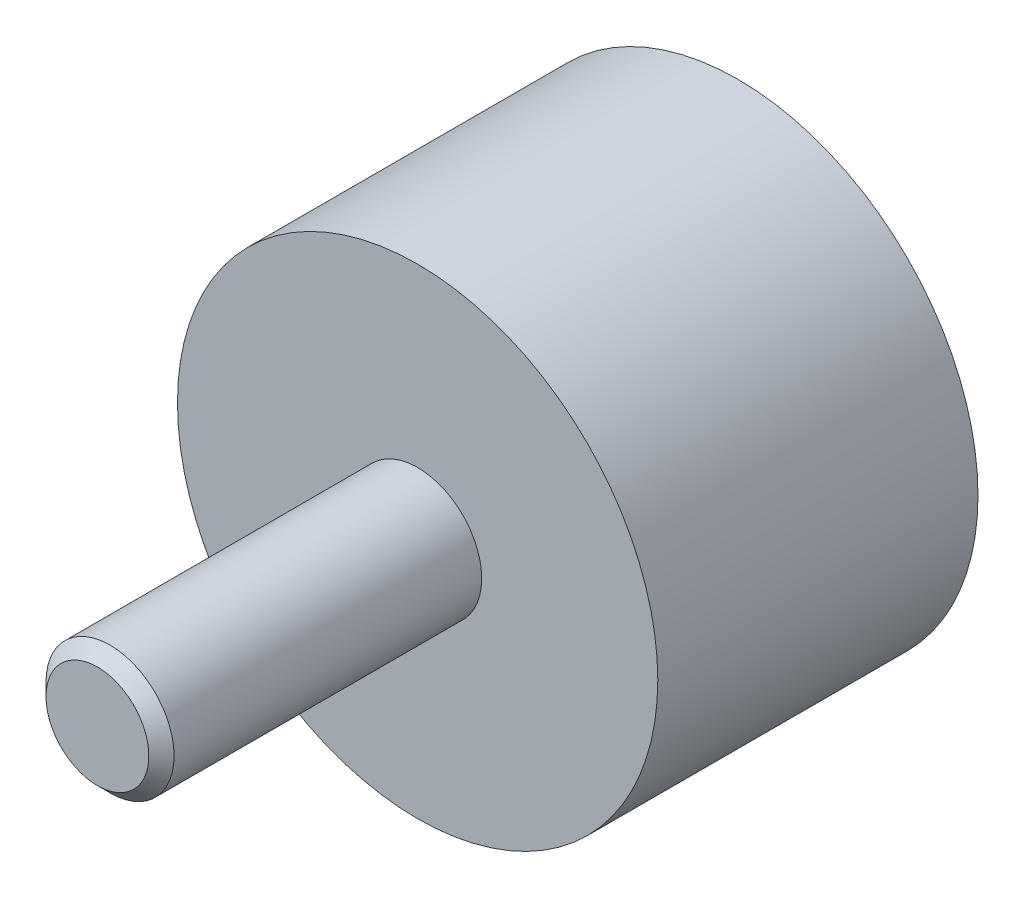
ISO-10303-21;
HEADER;
FILE_DESCRIPTION(('STEP AP214'),'2;1');
FILE_NAME('part.step','',(''),(''),'','','');
FILE_SCHEMA(('AUTOMOTIVE_DESIGN { 1 0 10303 214 1 1 1 1 }'));
ENDSEC;
DATA;
#1=APPLICATION_CONTEXT('core data for automotive mechanical design processes');
#2=APPLICATION_PROTOCOL_DEFINITION('international standard','automotive_design',2000,#1);
#3=PRODUCT_CONTEXT('',#1,'mechanical');
#4=PRODUCT('Part','Part','',(#3));
#5=PRODUCT_RELATED_PRODUCT_CATEGORY('part','',(#4));
#6=PRODUCT_DEFINITION_FORMATION('','',#4);
#7=PRODUCT_DEFINITION_CONTEXT('part definition',#1,'design');
#8=PRODUCT_DEFINITION('design','',#6,#7);
#9=PRODUCT_DEFINITION_SHAPE('','',#8);
#10=(LENGTH_UNIT() NAMED_UNIT(*) SI_UNIT(.MILLI.,.METRE.));
#11=(NAMED_UNIT(*) PLANE_ANGLE_UNIT() SI_UNIT($,.RADIAN.));
#12=(NAMED_UNIT(*) SI_UNIT($,.STERADIAN.) SOLID_ANGLE_UNIT());
#13=UNCERTAINTY_MEASURE_WITH_UNIT(LENGTH_MEASURE(1.E-05),#10,'distance_accuracy_value','');
#14=(GEOMETRIC_REPRESENTATION_CONTEXT(3) GLOBAL_UNCERTAINTY_ASSIGNED_CONTEXT((#13)) GLOBAL_UNIT_ASSIGNED_CONTEXT((#10,
#11,#12)) REPRESENTATION_CONTEXT('',''));
#15=CARTESIAN_POINT('',(0.,0.,0.));
#16=DIRECTION('',(0.,0.,1.));
#17=DIRECTION('',(1.,0.,0.));
#18=AXIS2_PLACEMENT_3D('',#15,#16,#17);
#19=CARTESIAN_POINT('',(0.,0.,0.5));
#20=DIRECTION('',(0.,0.,1.));
#21=DIRECTION('',(0.,-1.,0.));
#22=AXIS2_PLACEMENT_3D('',#19,#20,#21);
#23=CYLINDRICAL_SURFACE('',#22,15.);
#24=CARTESIAN_POINT('',(0.,0.,0.));
#25=DIRECTION('',(0.,0.,1.));
#26=DIRECTION('',(0.,-1.,0.));
#27=AXIS2_PLACEMENT_3D('',#24,#25,#26);
#28=CIRCLE('',#27,15.);
#29=CARTESIAN_POINT('',(0.,-15.,0.));
#30=VERTEX_POINT('',#29);
#31=EDGE_CURVE('E27',#30,#30,#28,.T.);
#32=ORIENTED_EDGE('',*,*,#31,.T.);
#33=EDGE_LOOP('',(#32));
#34=FACE_BOUND('',#33,.T.);
#35=CARTESIAN_POINT('',(0.,0.,20.));
#36=DIRECTION('',(0.,0.,-1.));
#37=DIRECTION('',(-1.,0.,0.));
#38=AXIS2_PLACEMENT_3D('',#35,#36,#37);
#39=CIRCLE('',#38,15.);
#40=CARTESIAN_POINT('',(-15.,0.,20.));
#41=VERTEX_POINT('',#40);
#42=EDGE_CURVE('E32',#41,#41,#39,.T.);
#43=ORIENTED_EDGE('',*,*,#42,.T.);
#44=EDGE_LOOP('',(#43));
#45=FACE_BOUND('',#44,.T.);
#46=ADVANCED_FACE('F12',(#34,#45),#23,.T.);
#47=CARTESIAN_POINT('',(15.,0.,0.));
#48=DIRECTION('',(0.,0.,-1.));
#49=DIRECTION('',(0.,1.,0.));
#50=AXIS2_PLACEMENT_3D('',#47,#48,#49);
#51=PLANE('',#50);
#52=CARTESIAN_POINT('',(0.,0.,0.));
#53=DIRECTION('',(0.,0.,-1.));
#54=DIRECTION('',(0.,1.,0.));
#55=AXIS2_PLACEMENT_3D('',#52,#53,#54);
#56=CIRCLE('',#55,4.45);
#57=CARTESIAN_POINT('',(0.,4.45,0.));
#58=VERTEX_POINT('',#57);
#59=EDGE_CURVE('E19',#58,#58,#56,.F.);
#60=ORIENTED_EDGE('',*,*,#59,.T.);
#61=EDGE_LOOP('',(#60));
#62=FACE_BOUND('',#61,.T.);
#63=ORIENTED_EDGE('',*,*,#31,.F.);
#64=EDGE_LOOP('',(#63));
#65=FACE_BOUND('',#64,.T.);
#66=ADVANCED_FACE('F49',(#62,#65),#51,.T.);
#67=CARTESIAN_POINT('',(0.,0.,0.));
#68=DIRECTION('',(0.,0.,1.));
#69=DIRECTION('',(0.,-1.,0.));
#70=AXIS2_PLACEMENT_3D('',#67,#68,#69);
#71=CYLINDRICAL_SURFACE('',#70,4.);
#72=CARTESIAN_POINT('',(0.,0.,0.449999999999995));
#73=DIRECTION('',(0.,0.,-1.));
#74=DIRECTION('',(0.,1.,0.));
#75=AXIS2_PLACEMENT_3D('',#72,#73,#74);
#76=CIRCLE('',#75,4.);
#77=CARTESIAN_POINT('',(0.,4.,0.449999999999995));
#78=VERTEX_POINT('',#77);
#79=EDGE_CURVE('E23',#78,#78,#76,.T.);
#80=ORIENTED_EDGE('',*,*,#79,.T.);
#81=EDGE_LOOP('',(#80));
#82=FACE_BOUND('',#81,.T.);
#83=CARTESIAN_POINT('',(0.,0.,8.));
#84=DIRECTION('',(0.,0.,-1.));
#85=DIRECTION('',(-1.,0.,0.));
#86=AXIS2_PLACEMENT_3D('',#83,#84,#85);
#87=CIRCLE('',#86,4.);
#88=CARTESIAN_POINT('',(-4.,0.,8.));
#89=VERTEX_POINT('',#88);
#90=EDGE_CURVE('E41',#89,#89,#87,.T.);
#91=ORIENTED_EDGE('',*,*,#90,.F.);
#92=EDGE_LOOP('',(#91));
#93=FACE_BOUND('',#92,.T.);
#94=ADVANCED_FACE('F47',(#82,#93),#71,.F.);
#95=CARTESIAN_POINT('',(0.,0.,0.449999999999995));
#96=DIRECTION('',(0.,0.,-1.));
#97=DIRECTION('',(0.,1.,0.));
#98=AXIS2_PLACEMENT_3D('',#95,#96,#97);
#99=CONICAL_SURFACE('',#98,4.,0.785398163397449);
#100=ORIENTED_EDGE('',*,*,#59,.F.);
#101=EDGE_LOOP('',(#100));
#102=FACE_BOUND('',#101,.T.);
#103=ORIENTED_EDGE('',*,*,#79,.F.);
#104=EDGE_LOOP('',(#103));
#105=FACE_BOUND('',#104,.T.);
#106=ADVANCED_FACE('F14',(#102,#105),#99,.F.);
#107=CARTESIAN_POINT('',(0.,15.,20.));
#108=DIRECTION('',(0.,0.,1.));
#109=DIRECTION('',(1.,0.,0.));
#110=AXIS2_PLACEMENT_3D('',#107,#108,#109);
#111=PLANE('',#110);
#112=CARTESIAN_POINT('',(0.,0.,20.));
#113=DIRECTION('',(0.,0.,1.));
#114=DIRECTION('',(1.,0.,0.));
#115=AXIS2_PLACEMENT_3D('',#112,#113,#114);
#116=CIRCLE('',#115,4.);
#117=CARTESIAN_POINT('',(4.,0.,20.));
#118=VERTEX_POINT('',#117);
#119=EDGE_CURVE('E8',#118,#118,#116,.F.);
#120=ORIENTED_EDGE('',*,*,#119,.T.);
#121=EDGE_LOOP('',(#120));
#122=FACE_BOUND('',#121,.T.);
#123=ORIENTED_EDGE('',*,*,#42,.F.);
#124=EDGE_LOOP('',(#123));
#125=FACE_BOUND('',#124,.T.);
#126=ADVANCED_FACE('F58',(#122,#125),#111,.T.);
#127=CARTESIAN_POINT('',(0.,0.,15.));
#128=DIRECTION('',(0.,0.,1.));
#129=DIRECTION('',(0.,-1.,0.));
#130=AXIS2_PLACEMENT_3D('',#127,#128,#129);
#131=CYLINDRICAL_SURFACE('',#130,4.);
#132=ORIENTED_EDGE('',*,*,#119,.F.);
#133=EDGE_LOOP('',(#132));
#134=FACE_BOUND('',#133,.T.);
#135=CARTESIAN_POINT('',(0.,0.,39.2115763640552));
#136=DIRECTION('',(0.,0.,-1.));
#137=DIRECTION('',(-1.,0.,0.));
#138=AXIS2_PLACEMENT_3D('',#135,#136,#137);
#139=CIRCLE('',#138,4.);
#140=CARTESIAN_POINT('',(-4.,0.,39.2115763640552));
#141=VERTEX_POINT('',#140);
#142=EDGE_CURVE('E35',#141,#141,#139,.T.);
#143=ORIENTED_EDGE('',*,*,#142,.T.);
#144=EDGE_LOOP('',(#143));
#145=FACE_BOUND('',#144,.T.);
#146=ADVANCED_FACE('F72',(#134,#145),#131,.T.);
#147=CARTESIAN_POINT('',(0.,0.,39.2115763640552));
#148=DIRECTION('',(0.,0.,-1.));
#149=DIRECTION('',(-1.,0.,0.));
#150=AXIS2_PLACEMENT_3D('',#147,#148,#149);
#151=CONICAL_SURFACE('',#150,4.,0.785398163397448);
#152=CARTESIAN_POINT('',(0.,0.,40.));
#153=DIRECTION('',(0.,0.,-1.));
#154=DIRECTION('',(-1.,0.,0.));
#155=AXIS2_PLACEMENT_3D('',#152,#153,#154);
#156=CIRCLE('',#155,3.21157636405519);
#157=CARTESIAN_POINT('',(-3.21157636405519,0.,40.));
#158=VERTEX_POINT('',#157);
#159=EDGE_CURVE('E38',#158,#158,#156,.T.);
#160=ORIENTED_EDGE('',*,*,#159,.T.);
#161=EDGE_LOOP('',(#160));
#162=FACE_BOUND('',#161,.T.);
#163=ORIENTED_EDGE('',*,*,#142,.F.);
#164=EDGE_LOOP('',(#163));
#165=FACE_BOUND('',#164,.T.);
#166=ADVANCED_FACE('F78',(#162,#165),#151,.T.);
#167=CARTESIAN_POINT('',(0.,3.21157636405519,40.));
#168=DIRECTION('',(0.,0.,1.));
#169=DIRECTION('',(1.,0.,0.));
#170=AXIS2_PLACEMENT_3D('',#167,#168,#169);
#171=PLANE('',#170);
#172=ORIENTED_EDGE('',*,*,#159,.F.);
#173=EDGE_LOOP('',(#172));
#174=FACE_BOUND('',#173,.T.);
#175=ADVANCED_FACE('F83',(#174),#171,.T.);
#176=CARTESIAN_POINT('',(0.,0.,8.));
#177=DIRECTION('',(0.,0.,-1.));
#178=DIRECTION('',(-1.,0.,0.));
#179=AXIS2_PLACEMENT_3D('',#176,#177,#178);
#180=PLANE('',#179);
#181=ORIENTED_EDGE('',*,*,#90,.T.);
#182=EDGE_LOOP('',(#181));
#183=FACE_BOUND('',#182,.T.);
#184=ADVANCED_FACE('F45',(#183),#180,.T.);
#185=CLOSED_SHELL('',(#46,#66,#94,#106,#126,#146,#166,#175,#184));
#186=MANIFOLD_SOLID_BREP('B1',#185);
#187=ADVANCED_BREP_SHAPE_REPRESENTATION('',(#18,#186),#14);
#188=SHAPE_DEFINITION_REPRESENTATION(#9,#187);
ENDSEC;
END-ISO-10303-21;
